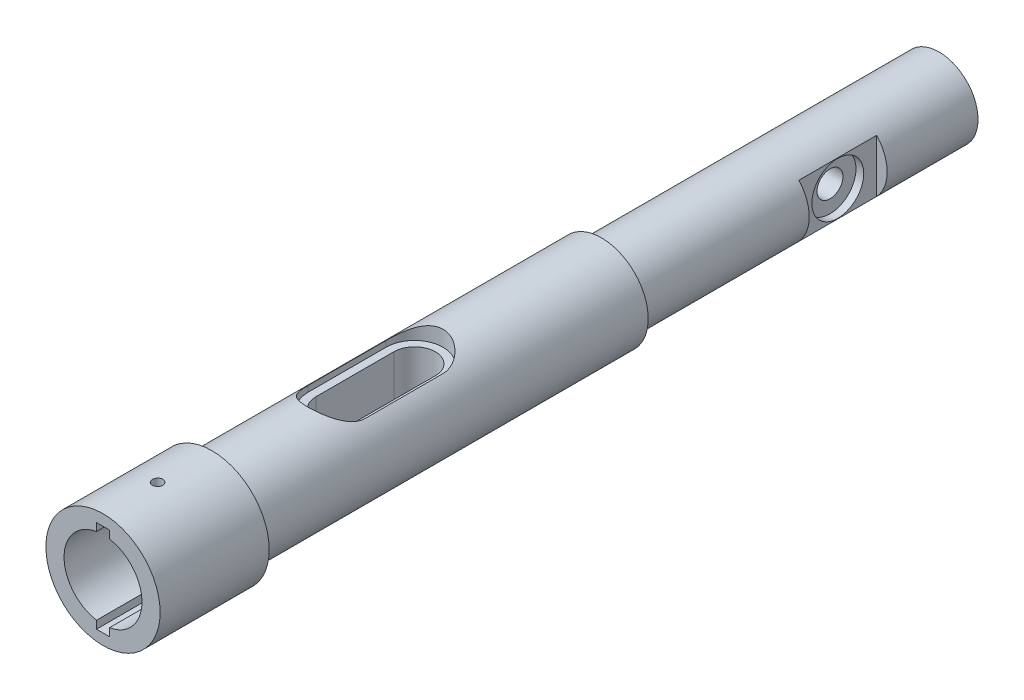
from build123d import *

# Parameters (mm, degrees)
SKETCH1_R               = 11
BASE_EXTRUDE_DEPTH      = 96
SKETCH2_R               = 7.5
BOSS_EXTRUDE1_DEPTH     = 65
CUT_EXTRUDE3_DEPTH      = 162.749806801
CUT_EXTRUDE3_DEPTH_BACK = 162.749806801
SKETCH10_OUTSIDE_W      = 56.796
SKETCH10_OUTSIDE_H      = 56.796
SKETCH10_OUTSIDE_R      = 9
CUT_EXTRUDE4_DEPTH      = 75
CUT_EXTRUDE8_DEPTH      = 3
SKETCH24_W              = 15
SKETCH24_H              = 15
CUT_EXTRUDE13_DEPTH     = 2
CUT_EXTRUDE15_DEPTH     = 18
SKETCH25_R              = 1
CUT_EXTRUDE16_DEPTH     = 28
CUT_EXTRUDE16_DRAFT     = -1


with BuildPart() as part:
    # Sketch1 → Base-Extrude (new body)
    with BuildSketch(Plane.XY):
        Circle(SKETCH1_R)
    extrude(amount=-BASE_EXTRUDE_DEPTH)

    # Sketch2 → Boss-Extrude1 (add)
    with BuildSketch(Plane(origin=(0, 0, -96), x_dir=(-1, 0, 0), z_dir=(0, 0, -1))):
        with Locations(Location((0, 0, 0), (0, 0, 180))):
            Circle(SKETCH2_R)
    extrude(amount=BOSS_EXTRUDE1_DEPTH)

    # Sketch9 → Cut-Extrude3 (cut, two sides: drawn at the far end of the back side and taken through both)
    with BuildSketch(Plane(origin=(0, 0, 0), x_dir=(1, 0, 0), z_dir=(0, 1, 0)).offset(-CUT_EXTRUDE3_DEPTH_BACK)):
        with BuildLine():
            Line((-4, 60), (-4, 45))
            ThreePointArc((-4, 45), (0, 41), (4, 45))
            Line((4, 45), (4, 60))
            ThreePointArc((4, 60), (0, 64), (-4, 60))
        make_face()
    extrude(amount=CUT_EXTRUDE3_DEPTH + CUT_EXTRUDE3_DEPTH_BACK, mode=Mode.SUBTRACT)

    # Sketch10 outside → Cut-Extrude4 (cut)
    with BuildSketch(Plane(origin=(0, 0, -96), x_dir=(-1, 0, 0), z_dir=(0, 0, -1))):
        Rectangle(SKETCH10_OUTSIDE_W, SKETCH10_OUTSIDE_H)
        Circle(SKETCH10_OUTSIDE_R, mode=Mode.SUBTRACT)
    extrude(amount=-CUT_EXTRUDE4_DEPTH, mode=Mode.SUBTRACT)

    # Sketch16 → Cut-Extrude8 (cut)
    with BuildSketch(Plane(origin=(0, 9, -58.5), x_dir=(1, 0, 0), z_dir=(0, 1, 0))):
        with BuildLine():
            Line((5.5, -13.5), (5.5, 1.5))
            ThreePointArc((5.5, 1.5), (0, 7), (-5.5, 1.5))
            Line((-5.5, 1.5), (-5.5, -13.5))
            ThreePointArc((-5.5, -13.5), (0, -19), (5.5, -13.5))
        make_face()
    cut_extrude8 = extrude(amount=-CUT_EXTRUDE8_DEPTH, mode=Mode.SUBTRACT)

    # Mirror2: Cut-Extrude8 across plane
    add(cut_extrude8.mirror(Plane.ZX), mode=Mode.SUBTRACT)

    # Sketch23 → Cut-Revolve2 (revolve, cut)
    with BuildSketch(Plane(origin=(0, 0, 0), x_dir=(1, 0, 0), z_dir=(0, 1, 0))):
        Polygon((-7.5, 136), (-7.5, 141), (-4, 141), (-4, 138.5), (4, 138.5), (4, 141), (7.5, 141), (7.5, 136), align=None)
    revolve(axis=Axis((7.5, 0, -136), (-1, 0, 0)), mode=Mode.SUBTRACT)

    # Sketch24 → Cut-Extrude13 (cut)
    with BuildSketch(Plane(origin=(7.5, 0, -128.5), x_dir=(0, 1, 0), z_dir=(1, 0, 0))):
        with Locations((0, -7.5)):
            Rectangle(SKETCH24_W, SKETCH24_H)
    cut_extrude13 = extrude(amount=-CUT_EXTRUDE13_DEPTH, mode=Mode.SUBTRACT)

    # Mirror3: Cut-Extrude13 across plane
    add(cut_extrude13.mirror(Plane(origin=(0, 0, 0), x_dir=(0, 0, 1), z_dir=(1, 0, 0))), mode=Mode.SUBTRACT)

    # Sketch11 → Cut-Extrude15 (cut)
    with BuildSketch(Plane(origin=(0, 0, 0), x_dir=(0, -1, 0), z_dir=(0, 0, 1))):
        with BuildLine():
            Line((7.395099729, 1.25), (8.895099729, 1.25))
            Line((8.895099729, 1.25), (8.895099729, -1.25))
            Line((8.895099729, -1.25), (7.395099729, -1.25))
            ThreePointArc((7.395099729, -1.25), (0, -7.5), (-7.395099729, -1.25))
            Line((-7.395099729, -1.25), (-8.895099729, -1.25))
            Line((-8.895099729, -1.25), (-8.895099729, 1.25))
            Line((-8.895099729, 1.25), (-7.395099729, 1.25))
            ThreePointArc((-7.395099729, 1.25), (0, 7.5), (7.395099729, 1.25))
        make_face()
    extrude(amount=-CUT_EXTRUDE15_DEPTH, mode=Mode.SUBTRACT)


with BuildPart() as cut_extrude16_tool:
    # Sketch25 → Cut-Extrude16 (with draft: the straight prism first)
    with BuildSketch(Plane(origin=(0, 11, -10.5), x_dir=(1, 0, 0), z_dir=(0, 1, 0))):
        Circle(SKETCH25_R)
    extrude(amount=-CUT_EXTRUDE16_DEPTH)
    # Cut-Extrude16: the draft: its side faces are tilted about the plane it starts from
    cut_extrude16_sides = [cut_extrude16_tool.faces().sort_by_distance(p)[0] for p in [
        (-1, -3, -10.5),
    ]]
    draft(cut_extrude16_sides, Plane(origin=(0, 11, -10.5), x_dir=(1, 0, 0), z_dir=(0, 1, 0)), CUT_EXTRUDE16_DRAFT)


with BuildPart() as part_1:
    add(part.part)

    # Cut-Extrude16: cut by cut_extrude16_tool
    add(cut_extrude16_tool.part, mode=Mode.SUBTRACT)


solid = part_1.part
